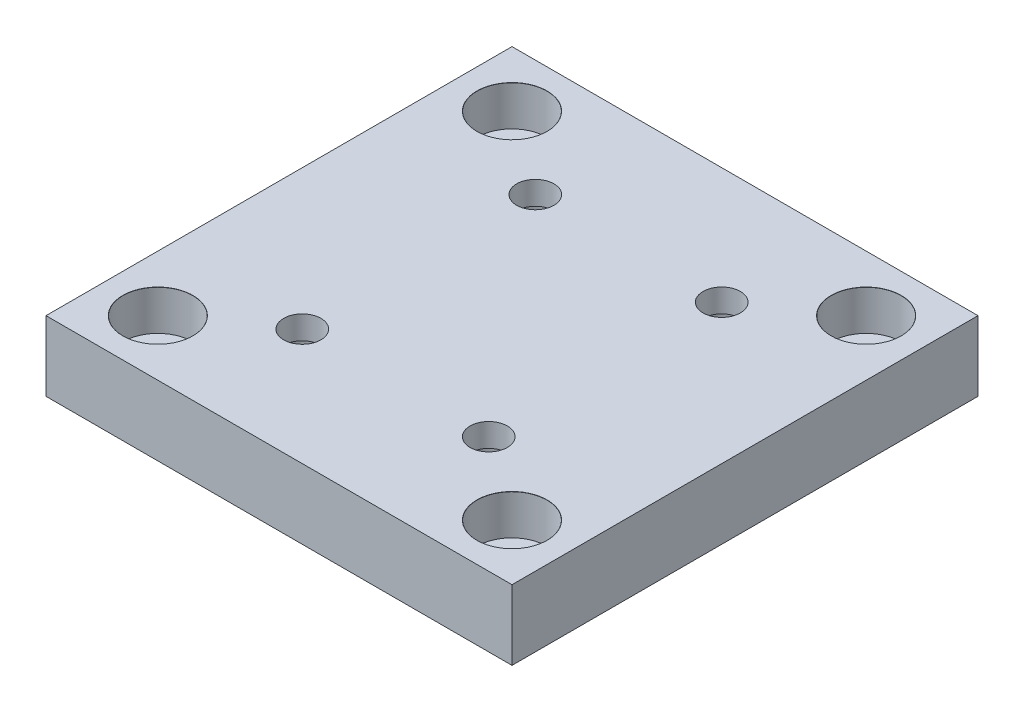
from build123d import *

# Parameters (mm, degrees)
SKETCH1_W                                    = 100
SKETCH1_H                                    = 100
BOSS_EXTRUDE1_DEPTH                          = 15
SKETCH2_R                                    = 4
CUT_EXTRUDE2_DEPTH                           = 15
SKETCH3_R                                    = 6.25
CUT_EXTRUDE3_DEPTH                           = 10
CBORE_FOR_M8_HEX_SOCKET_HEAD_CAP_SCR_2_COUNT = 2
CBORE_FOR_M8_HEX_SOCKET_HEAD_CAP_SCR_2_PITCH = 76
CBORE_FOR_M8_HEX_SOCKET_HEAD_CAP_SCR_3_COUNT = 2
CBORE_FOR_M8_HEX_SOCKET_HEAD_CAP_SCR_3_PITCH = 107.48023074
CBORE_FOR_M8_HEX_SOCKET_HEAD_CAP_SCR_4_COUNT = 2
CBORE_FOR_M8_HEX_SOCKET_HEAD_CAP_SCR_4_PITCH = 76


with BuildPart() as part:
    # Sketch1 → Boss-Extrude1 (new body)
    with BuildSketch(Plane(origin=(0, 0, 0), x_dir=(1, 0, 0), z_dir=(0, 1, 0))):
        Rectangle(SKETCH1_W, SKETCH1_H)
    extrude(amount=BOSS_EXTRUDE1_DEPTH)

    # Sketch2 → Cut-Extrude2 (cut)
    with BuildSketch(Plane(origin=(0, 0, 0), x_dir=(-1, 0, 0), z_dir=(0, -1, 0))):
        with Locations(Location((20, -25, 0), (0, 0, 90))):
            Circle(SKETCH2_R)
        with Locations(Location((20, 25, 0), (0, 0, 90))):
            Circle(SKETCH2_R)
        with Locations(Location((-20, 25, 0), (0, 0, 90))):
            Circle(SKETCH2_R)
        with Locations(Location((-20, -25, 0), (0, 0, 90))):
            Circle(SKETCH2_R)
    extrude(amount=-CUT_EXTRUDE2_DEPTH, mode=Mode.SUBTRACT)

    # Sketch3 → Cut-Extrude3 (cut)
    with BuildSketch(Plane.XZ):
        with Locations(Location((-20, 25, 0), (0, 0, 270))):
            Circle(SKETCH3_R)
        with Locations(Location((-20, -25, 0), (0, 0, 270))):
            Circle(SKETCH3_R)
        with Locations(Location((20, -25, 0), (0, 0, 270))):
            Circle(SKETCH3_R)
        with Locations(Location((20, 25, 0), (0, 0, 270))):
            Circle(SKETCH3_R)
    extrude(amount=-CUT_EXTRUDE3_DEPTH, mode=Mode.SUBTRACT)

    # Sketch5 → CBORE for M8 Hex Socket Head Cap Screw1 (revolve, cut)
    with BuildSketch(Plane(origin=(-38, 15, -38), x_dir=(0, 0, 1), z_dir=(1, 0, 0))):
        Polygon((0, 0), (0, 15), (4.5, 15), (4.5, 8.6), (7.5, 8.6), (7.5, 0.025), (7.525, 0), align=None)
    cbore_for_m8_hex_socket_head_cap_screw1 = revolve(axis=Axis((-38, 21.35, -38), (0, -1, 0)), mode=Mode.SUBTRACT)

    # CBORE for M8 Hex Socket Head Cap Scr 2: CBORE for M8 Hex Socket Head Cap Screw1 ×2
    with Locations(*[(0, 0, i * CBORE_FOR_M8_HEX_SOCKET_HEAD_CAP_SCR_2_PITCH) for i in range(1, CBORE_FOR_M8_HEX_SOCKET_HEAD_CAP_SCR_2_COUNT)]):
        add(cbore_for_m8_hex_socket_head_cap_screw1, mode=Mode.SUBTRACT)

    # CBORE for M8 Hex Socket Head Cap Scr 3: CBORE for M8 Hex Socket Head Cap Screw1 ×2
    with Locations(*[Vector(0.7071067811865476, 0, 0.7071067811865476) * (i * CBORE_FOR_M8_HEX_SOCKET_HEAD_CAP_SCR_3_PITCH) for i in range(1, CBORE_FOR_M8_HEX_SOCKET_HEAD_CAP_SCR_3_COUNT)]):
        add(cbore_for_m8_hex_socket_head_cap_screw1, mode=Mode.SUBTRACT)

    # CBORE for M8 Hex Socket Head Cap Scr 4: CBORE for M8 Hex Socket Head Cap Screw1 ×2
    with Locations(*[(i * CBORE_FOR_M8_HEX_SOCKET_HEAD_CAP_SCR_4_PITCH, 0, 0) for i in range(1, CBORE_FOR_M8_HEX_SOCKET_HEAD_CAP_SCR_4_COUNT)]):
        add(cbore_for_m8_hex_socket_head_cap_screw1, mode=Mode.SUBTRACT)


solid = part.part
